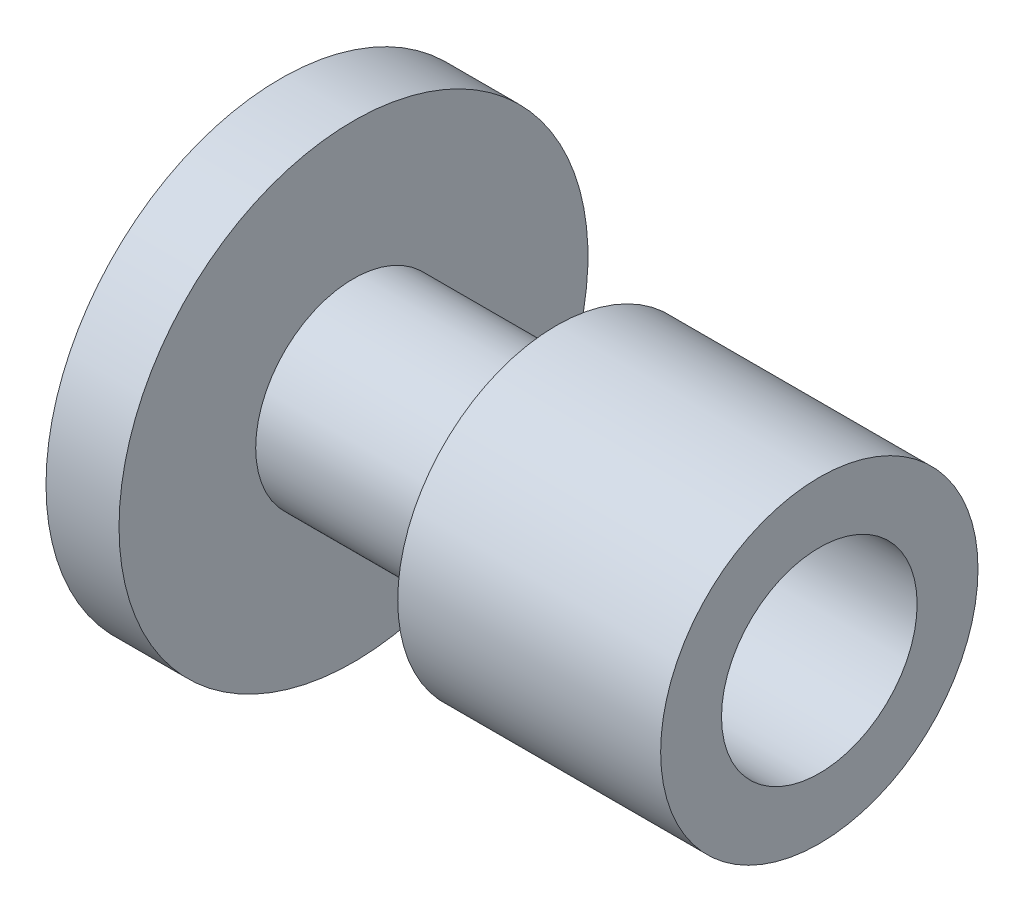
ISO-10303-21;
HEADER;
FILE_DESCRIPTION(('STEP AP214'),'2;1');
FILE_NAME('part.step','',(''),(''),'','','');
FILE_SCHEMA(('AUTOMOTIVE_DESIGN { 1 0 10303 214 1 1 1 1 }'));
ENDSEC;
DATA;
#1=APPLICATION_CONTEXT('core data for automotive mechanical design processes');
#2=APPLICATION_PROTOCOL_DEFINITION('international standard','automotive_design',2000,#1);
#3=PRODUCT_CONTEXT('',#1,'mechanical');
#4=PRODUCT('Part','Part','',(#3));
#5=PRODUCT_RELATED_PRODUCT_CATEGORY('part','',(#4));
#6=PRODUCT_DEFINITION_FORMATION('','',#4);
#7=PRODUCT_DEFINITION_CONTEXT('part definition',#1,'design');
#8=PRODUCT_DEFINITION('design','',#6,#7);
#9=PRODUCT_DEFINITION_SHAPE('','',#8);
#10=(LENGTH_UNIT() NAMED_UNIT(*) SI_UNIT(.MILLI.,.METRE.));
#11=(NAMED_UNIT(*) PLANE_ANGLE_UNIT() SI_UNIT($,.RADIAN.));
#12=(NAMED_UNIT(*) SI_UNIT($,.STERADIAN.) SOLID_ANGLE_UNIT());
#13=UNCERTAINTY_MEASURE_WITH_UNIT(LENGTH_MEASURE(1.E-05),#10,'distance_accuracy_value','');
#14=(GEOMETRIC_REPRESENTATION_CONTEXT(3) GLOBAL_UNCERTAINTY_ASSIGNED_CONTEXT((#13)) GLOBAL_UNIT_ASSIGNED_CONTEXT((#10,
#11,#12)) REPRESENTATION_CONTEXT('',''));
#15=CARTESIAN_POINT('',(0.,0.,0.));
#16=DIRECTION('',(0.,0.,1.));
#17=DIRECTION('',(1.,0.,0.));
#18=AXIS2_PLACEMENT_3D('',#15,#16,#17);
#19=CARTESIAN_POINT('',(0.,0.,0.));
#20=DIRECTION('',(-1.,0.,0.));
#21=DIRECTION('',(0.,0.,1.));
#22=AXIS2_PLACEMENT_3D('',#19,#20,#21);
#23=CYLINDRICAL_SURFACE('',#22,30.3529754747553);
#24=CARTESIAN_POINT('',(0.,0.,0.));
#25=DIRECTION('',(-1.,0.,0.));
#26=DIRECTION('',(0.,0.,1.));
#27=AXIS2_PLACEMENT_3D('',#24,#25,#26);
#28=CIRCLE('',#27,30.3529754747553);
#29=CARTESIAN_POINT('',(0.,0.,30.3529754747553));
#30=VERTEX_POINT('',#29);
#31=EDGE_CURVE('E69',#30,#30,#28,.T.);
#32=ORIENTED_EDGE('',*,*,#31,.F.);
#33=EDGE_LOOP('',(#32));
#34=FACE_BOUND('',#33,.T.);
#35=CARTESIAN_POINT('',(9.45341203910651,0.,0.));
#36=DIRECTION('',(-1.,0.,0.));
#37=DIRECTION('',(0.,0.,1.));
#38=AXIS2_PLACEMENT_3D('',#35,#36,#37);
#39=CIRCLE('',#38,30.3529754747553);
#40=CARTESIAN_POINT('',(9.45341203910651,0.,30.3529754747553));
#41=VERTEX_POINT('',#40);
#42=EDGE_CURVE('E10',#41,#41,#39,.T.);
#43=ORIENTED_EDGE('',*,*,#42,.T.);
#44=EDGE_LOOP('',(#43));
#45=FACE_BOUND('',#44,.T.);
#46=ADVANCED_FACE('F35',(#34,#45),#23,.T.);
#47=CARTESIAN_POINT('',(9.45341203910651,30.3529754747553,0.));
#48=DIRECTION('',(-1.,0.,0.));
#49=DIRECTION('',(0.,0.,1.));
#50=AXIS2_PLACEMENT_3D('',#47,#48,#49);
#51=PLANE('',#50);
#52=ORIENTED_EDGE('',*,*,#42,.F.);
#53=EDGE_LOOP('',(#52));
#54=FACE_BOUND('',#53,.T.);
#55=CARTESIAN_POINT('',(9.45341203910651,0.,0.));
#56=DIRECTION('',(-1.,0.,0.));
#57=DIRECTION('',(0.,0.,1.));
#58=AXIS2_PLACEMENT_3D('',#55,#56,#57);
#59=CIRCLE('',#58,12.6631630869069);
#60=CARTESIAN_POINT('',(9.45341203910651,0.,12.6631630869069));
#61=VERTEX_POINT('',#60);
#62=EDGE_CURVE('E41',#61,#61,#59,.T.);
#63=ORIENTED_EDGE('',*,*,#62,.T.);
#64=EDGE_LOOP('',(#63));
#65=FACE_BOUND('',#64,.T.);
#66=ADVANCED_FACE('F76',(#54,#65),#51,.F.);
#67=CARTESIAN_POINT('',(0.,0.,0.));
#68=DIRECTION('',(-1.,0.,0.));
#69=DIRECTION('',(0.,0.,1.));
#70=AXIS2_PLACEMENT_3D('',#67,#68,#69);
#71=CYLINDRICAL_SURFACE('',#70,12.6631630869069);
#72=ORIENTED_EDGE('',*,*,#62,.F.);
#73=EDGE_LOOP('',(#72));
#74=FACE_BOUND('',#73,.T.);
#75=CARTESIAN_POINT('',(35.7210094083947,0.,0.));
#76=DIRECTION('',(-1.,0.,0.));
#77=DIRECTION('',(0.,0.,1.));
#78=AXIS2_PLACEMENT_3D('',#75,#76,#77);
#79=CIRCLE('',#78,12.6631630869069);
#80=CARTESIAN_POINT('',(35.7210094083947,0.,12.6631630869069));
#81=VERTEX_POINT('',#80);
#82=EDGE_CURVE('E45',#81,#81,#79,.T.);
#83=ORIENTED_EDGE('',*,*,#82,.T.);
#84=EDGE_LOOP('',(#83));
#85=FACE_BOUND('',#84,.T.);
#86=ADVANCED_FACE('F80',(#74,#85),#71,.T.);
#87=CARTESIAN_POINT('',(35.7210094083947,12.6631630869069,0.));
#88=DIRECTION('',(1.,0.,0.));
#89=DIRECTION('',(0.,0.,-1.));
#90=AXIS2_PLACEMENT_3D('',#87,#88,#89);
#91=PLANE('',#90);
#92=ORIENTED_EDGE('',*,*,#82,.F.);
#93=EDGE_LOOP('',(#92));
#94=FACE_BOUND('',#93,.T.);
#95=CARTESIAN_POINT('',(35.7210094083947,0.,0.));
#96=DIRECTION('',(-1.,0.,0.));
#97=DIRECTION('',(0.,0.,1.));
#98=AXIS2_PLACEMENT_3D('',#95,#96,#97);
#99=CIRCLE('',#98,20.5406576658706);
#100=CARTESIAN_POINT('',(35.7210094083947,0.,20.5406576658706));
#101=VERTEX_POINT('',#100);
#102=EDGE_CURVE('E49',#101,#101,#99,.T.);
#103=ORIENTED_EDGE('',*,*,#102,.T.);
#104=EDGE_LOOP('',(#103));
#105=FACE_BOUND('',#104,.T.);
#106=ADVANCED_FACE('F85',(#94,#105),#91,.F.);
#107=CARTESIAN_POINT('',(0.,0.,0.));
#108=DIRECTION('',(-1.,0.,0.));
#109=DIRECTION('',(0.,0.,1.));
#110=AXIS2_PLACEMENT_3D('',#107,#108,#109);
#111=CYLINDRICAL_SURFACE('',#110,20.5406576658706);
#112=ORIENTED_EDGE('',*,*,#102,.F.);
#113=EDGE_LOOP('',(#112));
#114=FACE_BOUND('',#113,.T.);
#115=CARTESIAN_POINT('',(69.7560680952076,0.,0.));
#116=DIRECTION('',(-1.,0.,0.));
#117=DIRECTION('',(0.,0.,1.));
#118=AXIS2_PLACEMENT_3D('',#115,#116,#117);
#119=CIRCLE('',#118,20.5406576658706);
#120=CARTESIAN_POINT('',(69.7560680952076,0.,20.5406576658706));
#121=VERTEX_POINT('',#120);
#122=EDGE_CURVE('E54',#121,#121,#119,.T.);
#123=ORIENTED_EDGE('',*,*,#122,.T.);
#124=EDGE_LOOP('',(#123));
#125=FACE_BOUND('',#124,.T.);
#126=ADVANCED_FACE('F91',(#114,#125),#111,.T.);
#127=CARTESIAN_POINT('',(69.7560680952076,20.5406576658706,0.));
#128=DIRECTION('',(-1.,0.,0.));
#129=DIRECTION('',(0.,0.,1.));
#130=AXIS2_PLACEMENT_3D('',#127,#128,#129);
#131=PLANE('',#130);
#132=ORIENTED_EDGE('',*,*,#122,.F.);
#133=EDGE_LOOP('',(#132));
#134=FACE_BOUND('',#133,.T.);
#135=CARTESIAN_POINT('',(69.7560680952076,0.,0.));
#136=DIRECTION('',(-1.,0.,0.));
#137=DIRECTION('',(0.,0.,1.));
#138=AXIS2_PLACEMENT_3D('',#135,#136,#137);
#139=CIRCLE('',#138,12.6631630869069);
#140=CARTESIAN_POINT('',(69.7560680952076,0.,12.6631630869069));
#141=VERTEX_POINT('',#140);
#142=EDGE_CURVE('E57',#141,#141,#139,.T.);
#143=ORIENTED_EDGE('',*,*,#142,.T.);
#144=EDGE_LOOP('',(#143));
#145=FACE_BOUND('',#144,.T.);
#146=ADVANCED_FACE('F95',(#134,#145),#131,.F.);
#147=CARTESIAN_POINT('',(0.,0.,0.));
#148=DIRECTION('',(-1.,0.,0.));
#149=DIRECTION('',(0.,0.,1.));
#150=AXIS2_PLACEMENT_3D('',#147,#148,#149);
#151=CYLINDRICAL_SURFACE('',#150,12.6631630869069);
#152=ORIENTED_EDGE('',*,*,#142,.F.);
#153=EDGE_LOOP('',(#152));
#154=FACE_BOUND('',#153,.T.);
#155=CARTESIAN_POINT('',(46.1235843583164,0.,0.));
#156=DIRECTION('',(-1.,0.,0.));
#157=DIRECTION('',(0.,0.,1.));
#158=AXIS2_PLACEMENT_3D('',#155,#156,#157);
#159=CIRCLE('',#158,12.6631630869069);
#160=CARTESIAN_POINT('',(46.1235843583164,0.,12.6631630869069));
#161=VERTEX_POINT('',#160);
#162=EDGE_CURVE('E60',#161,#161,#159,.T.);
#163=ORIENTED_EDGE('',*,*,#162,.T.);
#164=EDGE_LOOP('',(#163));
#165=FACE_BOUND('',#164,.T.);
#166=ADVANCED_FACE('F99',(#154,#165),#151,.F.);
#167=CARTESIAN_POINT('',(46.1235843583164,12.6631630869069,0.));
#168=DIRECTION('',(-1.,0.,0.));
#169=DIRECTION('',(0.,0.,1.));
#170=AXIS2_PLACEMENT_3D('',#167,#168,#169);
#171=PLANE('',#170);
#172=ORIENTED_EDGE('',*,*,#162,.F.);
#173=EDGE_LOOP('',(#172));
#174=FACE_BOUND('',#173,.T.);
#175=CARTESIAN_POINT('',(46.1235843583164,0.,0.));
#176=DIRECTION('',(-1.,0.,0.));
#177=DIRECTION('',(0.,0.,1.));
#178=AXIS2_PLACEMENT_3D('',#175,#176,#177);
#179=CIRCLE('',#178,9.51852801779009);
#180=CARTESIAN_POINT('',(46.1235843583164,0.,9.51852801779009));
#181=VERTEX_POINT('',#180);
#182=EDGE_CURVE('E63',#181,#181,#179,.T.);
#183=ORIENTED_EDGE('',*,*,#182,.T.);
#184=EDGE_LOOP('',(#183));
#185=FACE_BOUND('',#184,.T.);
#186=ADVANCED_FACE('F103',(#174,#185),#171,.F.);
#187=CARTESIAN_POINT('',(0.,0.,0.));
#188=DIRECTION('',(-1.,0.,0.));
#189=DIRECTION('',(0.,0.,1.));
#190=AXIS2_PLACEMENT_3D('',#187,#188,#189);
#191=CYLINDRICAL_SURFACE('',#190,9.51852801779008);
#192=ORIENTED_EDGE('',*,*,#182,.F.);
#193=EDGE_LOOP('',(#192));
#194=FACE_BOUND('',#193,.T.);
#195=CARTESIAN_POINT('',(7.54748927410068,0.,0.));
#196=DIRECTION('',(-1.,0.,0.));
#197=DIRECTION('',(0.,0.,1.));
#198=AXIS2_PLACEMENT_3D('',#195,#196,#197);
#199=CIRCLE('',#198,9.51852801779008);
#200=CARTESIAN_POINT('',(7.54748927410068,0.,9.51852801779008));
#201=VERTEX_POINT('',#200);
#202=EDGE_CURVE('E66',#201,#201,#199,.T.);
#203=ORIENTED_EDGE('',*,*,#202,.T.);
#204=EDGE_LOOP('',(#203));
#205=FACE_BOUND('',#204,.T.);
#206=ADVANCED_FACE('F107',(#194,#205),#191,.F.);
#207=CARTESIAN_POINT('',(7.54748927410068,9.51852801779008,0.));
#208=DIRECTION('',(-1.,0.,0.));
#209=DIRECTION('',(0.,0.,1.));
#210=AXIS2_PLACEMENT_3D('',#207,#208,#209);
#211=PLANE('',#210);
#212=ORIENTED_EDGE('',*,*,#202,.F.);
#213=EDGE_LOOP('',(#212));
#214=FACE_BOUND('',#213,.T.);
#215=ADVANCED_FACE('F111',(#214),#211,.F.);
#216=CARTESIAN_POINT('',(0.,0.,0.));
#217=DIRECTION('',(1.,0.,0.));
#218=DIRECTION('',(0.,0.,-1.));
#219=AXIS2_PLACEMENT_3D('',#216,#217,#218);
#220=PLANE('',#219);
#221=ORIENTED_EDGE('',*,*,#31,.T.);
#222=EDGE_LOOP('',(#221));
#223=FACE_BOUND('',#222,.T.);
#224=ADVANCED_FACE('F73',(#223),#220,.F.);
#225=CLOSED_SHELL('',(#46,#66,#86,#106,#126,#146,#166,#186,#206,#215,#224));
#226=MANIFOLD_SOLID_BREP('B2',#225);
#227=ADVANCED_BREP_SHAPE_REPRESENTATION('',(#18,#226),#14);
#228=SHAPE_DEFINITION_REPRESENTATION(#9,#227);
ENDSEC;
END-ISO-10303-21;
